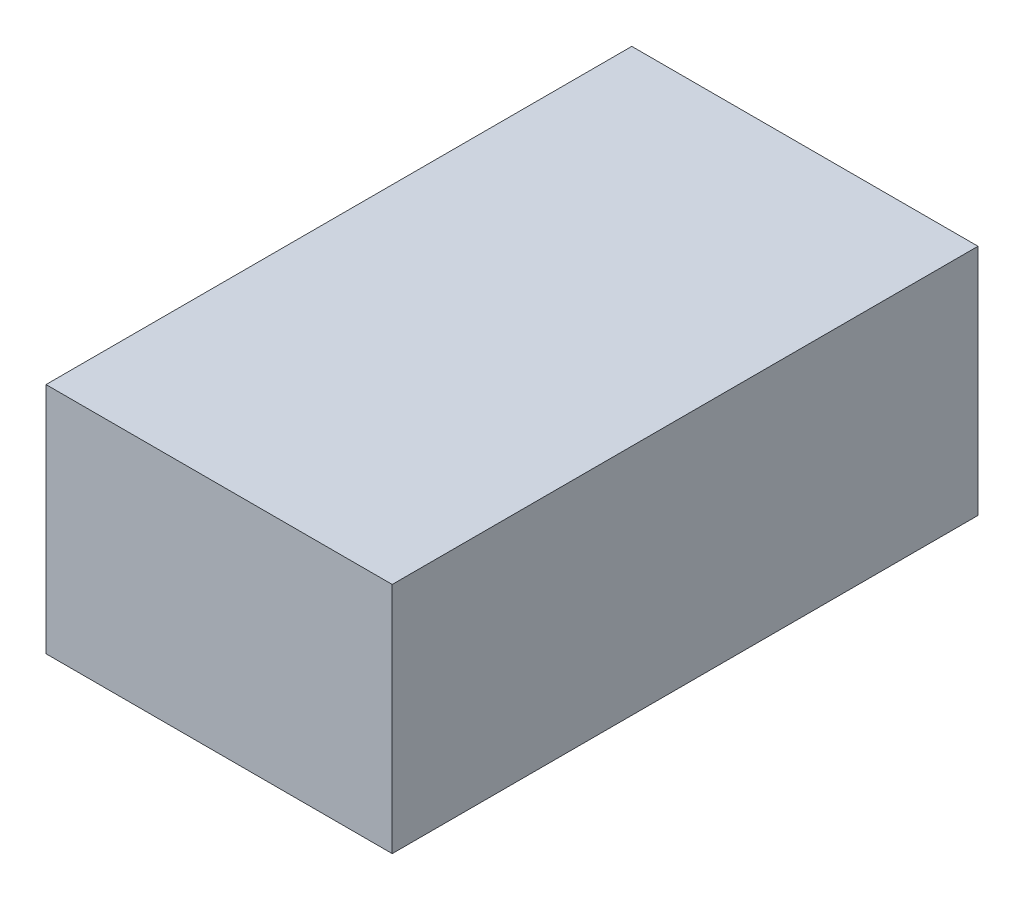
from build123d import *

# Parameters (mm, degrees)
SKIZZE1_W               = 118.20735584
SKIZZE1_H               = 79.59737354
LINEAR_AUSTRAGEN1_DEPTH = 100


with BuildPart() as part:
    # Skizze1 → Linear austragen1 (new, symmetric)
    with BuildSketch(Plane.XY):
        Rectangle(SKIZZE1_W, SKIZZE1_H)
    extrude(amount=LINEAR_AUSTRAGEN1_DEPTH, both=True)


solid = part.part
